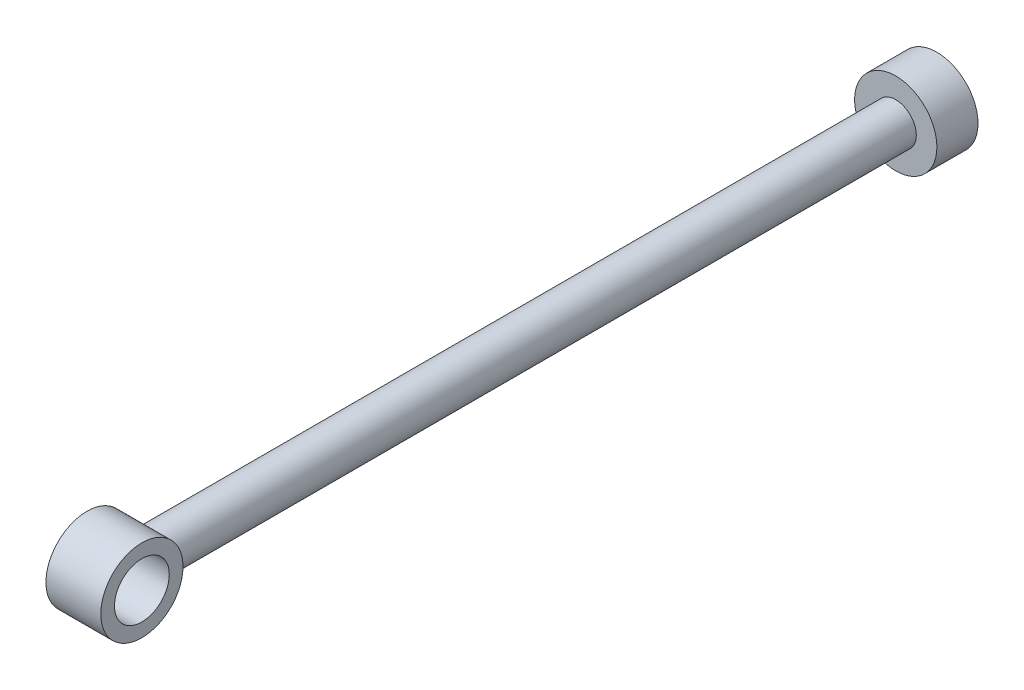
ISO-10303-21;
HEADER;
FILE_DESCRIPTION(('STEP AP214'),'2;1');
FILE_NAME('part.step','',(''),(''),'','','');
FILE_SCHEMA(('AUTOMOTIVE_DESIGN { 1 0 10303 214 1 1 1 1 }'));
ENDSEC;
DATA;
#1=APPLICATION_CONTEXT('core data for automotive mechanical design processes');
#2=APPLICATION_PROTOCOL_DEFINITION('international standard','automotive_design',2000,#1);
#3=PRODUCT_CONTEXT('',#1,'mechanical');
#4=PRODUCT('Part','Part','',(#3));
#5=PRODUCT_RELATED_PRODUCT_CATEGORY('part','',(#4));
#6=PRODUCT_DEFINITION_FORMATION('','',#4);
#7=PRODUCT_DEFINITION_CONTEXT('part definition',#1,'design');
#8=PRODUCT_DEFINITION('design','',#6,#7);
#9=PRODUCT_DEFINITION_SHAPE('','',#8);
#10=(LENGTH_UNIT() NAMED_UNIT(*) SI_UNIT(.MILLI.,.METRE.));
#11=(NAMED_UNIT(*) PLANE_ANGLE_UNIT() SI_UNIT($,.RADIAN.));
#12=(NAMED_UNIT(*) SI_UNIT($,.STERADIAN.) SOLID_ANGLE_UNIT());
#13=UNCERTAINTY_MEASURE_WITH_UNIT(LENGTH_MEASURE(1.E-05),#10,'distance_accuracy_value','');
#14=(GEOMETRIC_REPRESENTATION_CONTEXT(3) GLOBAL_UNCERTAINTY_ASSIGNED_CONTEXT((#13)) GLOBAL_UNIT_ASSIGNED_CONTEXT((#10,
#11,#12)) REPRESENTATION_CONTEXT('',''));
#15=CARTESIAN_POINT('',(0.,0.,0.));
#16=DIRECTION('',(0.,0.,1.));
#17=DIRECTION('',(1.,0.,0.));
#18=AXIS2_PLACEMENT_3D('',#15,#16,#17);
#19=CARTESIAN_POINT('',(0.,0.,575.));
#20=DIRECTION('',(0.,0.,-1.));
#21=DIRECTION('',(-1.,0.,0.));
#22=AXIS2_PLACEMENT_3D('',#19,#20,#21);
#23=CYLINDRICAL_SURFACE('',#22,15.);
#24=CARTESIAN_POINT('',(0.,0.,30.));
#25=DIRECTION('',(0.,0.,1.));
#26=DIRECTION('',(1.,0.,0.));
#27=AXIS2_PLACEMENT_3D('',#24,#25,#26);
#28=CIRCLE('',#27,15.);
#29=CARTESIAN_POINT('',(15.,0.,30.));
#30=VERTEX_POINT('',#29);
#31=EDGE_CURVE('E50',#30,#30,#28,.T.);
#32=ORIENTED_EDGE('',*,*,#31,.T.);
#33=EDGE_LOOP('',(#32));
#34=FACE_BOUND('',#33,.T.);
#35=CARTESIAN_POINT('',(-15.,0.,570.));
#36=CARTESIAN_POINT('',(-14.9999986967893,-0.394466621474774,570.000001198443));
#37=CARTESIAN_POINT('',(-14.9844217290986,-0.788960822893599,570.007798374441));
#38=CARTESIAN_POINT('',(-14.9222912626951,-1.57504384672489,570.038790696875));
#39=CARTESIAN_POINT('',(-14.8757242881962,-1.96663133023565,570.061992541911));
#40=CARTESIAN_POINT('',(-14.752062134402,-2.74444839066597,570.123245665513));
#41=CARTESIAN_POINT('',(-14.674915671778,-3.13066783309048,570.161321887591));
#42=CARTESIAN_POINT('',(-14.4909926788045,-3.89427274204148,570.251345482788));
#43=CARTESIAN_POINT('',(-14.3842191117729,-4.27165908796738,570.303291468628));
#44=CARTESIAN_POINT('',(-14.1426464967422,-5.01370255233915,570.419545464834));
#45=CARTESIAN_POINT('',(-14.0079586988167,-5.37840368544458,570.483804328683));
#46=CARTESIAN_POINT('',(-13.7115835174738,-6.09447648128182,570.623301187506));
#47=CARTESIAN_POINT('',(-13.5498955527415,-6.44584785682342,570.698539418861));
#48=CARTESIAN_POINT('',(-13.2009461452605,-7.13327098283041,570.858261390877));
#49=CARTESIAN_POINT('',(-13.0136941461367,-7.4693283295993,570.942741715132));
#50=CARTESIAN_POINT('',(-12.6148696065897,-8.12479620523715,571.119159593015));
#51=CARTESIAN_POINT('',(-12.4032874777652,-8.44420009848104,571.211100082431));
#52=CARTESIAN_POINT('',(-11.9437431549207,-9.08356730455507,571.406169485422));
#53=CARTESIAN_POINT('',(-11.6943566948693,-9.40240338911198,571.509638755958));
#54=CARTESIAN_POINT('',(-11.1713323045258,-10.0182110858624,571.720301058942));
#55=CARTESIAN_POINT('',(-10.8976929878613,-10.3151814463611,571.827494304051));
#56=CARTESIAN_POINT('',(-10.32744213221,-10.8860835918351,572.043134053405));
#57=CARTESIAN_POINT('',(-10.0308163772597,-11.1600008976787,572.151581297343));
#58=CARTESIAN_POINT('',(-9.41609706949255,-11.6833254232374,572.367048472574));
#59=CARTESIAN_POINT('',(-9.09799950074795,-11.9327280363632,572.474068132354));
#60=CARTESIAN_POINT('',(-8.41621019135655,-12.424066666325,572.692119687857));
#61=CARTESIAN_POINT('',(-8.05089693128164,-12.6639084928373,572.802814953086));
#62=CARTESIAN_POINT('',(-7.29906225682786,-13.1116371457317,573.01581142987));
#63=CARTESIAN_POINT('',(-6.91254992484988,-13.3195375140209,573.118116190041));
#64=CARTESIAN_POINT('',(-6.1204511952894,-13.7015816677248,573.310817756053));
#65=CARTESIAN_POINT('',(-5.71487061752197,-13.8757356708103,573.40121816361));
#66=CARTESIAN_POINT('',(-4.88717106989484,-14.1884178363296,573.566685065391));
#67=CARTESIAN_POINT('',(-4.46505393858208,-14.3269499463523,573.641753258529));
#68=CARTESIAN_POINT('',(-3.6331274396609,-14.5593818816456,573.769465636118));
#69=CARTESIAN_POINT('',(-3.22409061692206,-14.6554546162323,573.823181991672));
#70=CARTESIAN_POINT('',(-2.39742530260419,-14.8131483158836,573.912093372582));
#71=CARTESIAN_POINT('',(-1.97979717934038,-14.874770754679,573.947289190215));
#72=CARTESIAN_POINT('',(-1.1399780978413,-14.9625716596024,573.997615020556));
#73=CARTESIAN_POINT('',(-0.717791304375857,-14.9887801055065,574.012762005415));
#74=CARTESIAN_POINT('',(0.127503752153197,-15.0054120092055,574.022361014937));
#75=CARTESIAN_POINT('',(0.550611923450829,-14.9958388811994,574.016815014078));
#76=CARTESIAN_POINT('',(1.34318604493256,-14.9443693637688,573.987185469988));
#77=CARTESIAN_POINT('',(1.7130074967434,-14.9064815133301,573.965401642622));
#78=CARTESIAN_POINT('',(2.44761394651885,-14.8036048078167,573.90676729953));
#79=CARTESIAN_POINT('',(2.81239941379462,-14.7386184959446,573.869918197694));
#80=CARTESIAN_POINT('',(3.53465011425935,-14.5822778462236,573.782349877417));
#81=CARTESIAN_POINT('',(3.8921134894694,-14.490916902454,573.731627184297));
#82=CARTESIAN_POINT('',(4.5975509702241,-14.2827793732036,573.617879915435));
#83=CARTESIAN_POINT('',(4.94552456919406,-14.1660014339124,573.554854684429));
#84=CARTESIAN_POINT('',(5.63806138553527,-13.9051185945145,573.416735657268));
#85=CARTESIAN_POINT('',(5.98236177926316,-13.7604466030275,573.341397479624));
#86=CARTESIAN_POINT('',(6.6576488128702,-13.4467240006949,573.181786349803));
#87=CARTESIAN_POINT('',(6.9886306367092,-13.2776646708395,573.097510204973));
#88=CARTESIAN_POINT('',(7.63583954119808,-12.9163207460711,572.922168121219));
#89=CARTESIAN_POINT('',(7.95206429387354,-12.724032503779,572.831101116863));
#90=CARTESIAN_POINT('',(8.56852275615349,-12.3173373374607,572.644319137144));
#91=CARTESIAN_POINT('',(8.86875518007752,-12.1029286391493,572.548603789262));
#92=CARTESIAN_POINT('',(9.4892135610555,-11.6244221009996,572.342288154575));
#93=CARTESIAN_POINT('',(9.80713018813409,-11.357472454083,572.23134228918));
#94=CARTESIAN_POINT('',(10.4195910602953,-10.7983337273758,572.009171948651));
#95=CARTESIAN_POINT('',(10.7141433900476,-10.5061534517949,571.897947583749));
#96=CARTESIAN_POINT('',(11.2787205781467,-9.897619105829,571.677890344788));
#97=CARTESIAN_POINT('',(11.5487236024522,-9.58124396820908,571.569059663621));
#98=CARTESIAN_POINT('',(12.0621805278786,-8.9261925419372,571.356648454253));
#99=CARTESIAN_POINT('',(12.3056450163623,-8.58752523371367,571.253065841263));
#100=CARTESIAN_POINT('',(12.7751937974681,-7.87309152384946,571.049027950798));
#101=CARTESIAN_POINT('',(12.999931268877,-7.49633062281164,570.94894596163));
#102=CARTESIAN_POINT('',(13.4165538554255,-6.72229496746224,570.760139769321));
#103=CARTESIAN_POINT('',(13.608437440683,-6.32501925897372,570.671416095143));
#104=CARTESIAN_POINT('',(13.9571914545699,-5.51289034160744,570.507976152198));
#105=CARTESIAN_POINT('',(14.1140841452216,-5.09804850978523,570.433250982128));
#106=CARTESIAN_POINT('',(14.391076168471,-4.25373396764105,570.300028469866));
#107=CARTESIAN_POINT('',(14.5111797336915,-3.82426294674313,570.241529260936));
#108=CARTESIAN_POINT('',(14.7045987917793,-2.99040123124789,570.146713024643));
#109=CARTESIAN_POINT('',(14.780965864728,-2.58687987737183,570.108959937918));
#110=CARTESIAN_POINT('',(14.9004227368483,-1.77375891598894,570.049709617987));
#111=CARTESIAN_POINT('',(14.9435143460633,-1.36415964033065,570.028211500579));
#112=CARTESIAN_POINT('',(14.9958394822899,-0.542432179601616,570.002088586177));
#113=CARTESIAN_POINT('',(15.0050865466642,-0.130305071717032,569.997457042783));
#114=CARTESIAN_POINT('',(14.9896332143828,0.69314293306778,570.005182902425));
#115=CARTESIAN_POINT('',(14.9649343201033,1.10446386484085,570.017539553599));
#116=CARTESIAN_POINT('',(14.8851569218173,1.89104365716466,570.057274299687));
#117=CARTESIAN_POINT('',(14.8325856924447,2.26662317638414,570.083411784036));
#118=CARTESIAN_POINT('',(14.6994449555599,3.01155508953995,570.149198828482));
#119=CARTESIAN_POINT('',(14.6188772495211,3.38090788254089,570.188847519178));
#120=CARTESIAN_POINT('',(14.4305792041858,4.11102643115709,570.280732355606));
#121=CARTESIAN_POINT('',(14.322847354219,4.47179170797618,570.332969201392));
#122=CARTESIAN_POINT('',(14.0812572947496,5.18257720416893,570.448848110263));
#123=CARTESIAN_POINT('',(13.9473979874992,5.53259697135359,570.512490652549));
#124=CARTESIAN_POINT('',(13.6505393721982,6.22979935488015,570.651753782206));
#125=CARTESIAN_POINT('',(13.4868176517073,6.576616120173,570.727664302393));
#126=CARTESIAN_POINT('',(13.1343016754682,7.25508680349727,570.88839960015));
#127=CARTESIAN_POINT('',(12.9455071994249,7.58674058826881,570.973224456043));
#128=CARTESIAN_POINT('',(12.5441531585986,8.23341158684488,571.149985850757));
#129=CARTESIAN_POINT('',(12.3315897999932,8.5484261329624,571.241923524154));
#130=CARTESIAN_POINT('',(11.8839483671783,9.16054648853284,571.431012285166));
#131=CARTESIAN_POINT('',(11.6488615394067,9.45764526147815,571.528165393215));
#132=CARTESIAN_POINT('',(11.1333715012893,10.060839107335,571.735341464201));
#133=CARTESIAN_POINT('',(10.8507851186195,10.3649587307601,571.845692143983));
#134=CARTESIAN_POINT('',(10.2616154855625,10.9485707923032,572.06746929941));
#135=CARTESIAN_POINT('',(9.9550311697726,11.2280621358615,572.178895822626));
#136=CARTESIAN_POINT('',(9.31919419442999,11.761157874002,572.400027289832));
#137=CARTESIAN_POINT('',(8.98992792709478,12.0147464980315,572.50973115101));
#138=CARTESIAN_POINT('',(8.31037887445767,12.4944228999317,572.724397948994));
#139=CARTESIAN_POINT('',(7.96009249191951,12.7205059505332,572.829360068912));
#140=CARTESIAN_POINT('',(7.22261605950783,13.1539172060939,573.036414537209));
#141=CARTESIAN_POINT('',(6.83445930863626,13.3597919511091,573.138116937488));
#142=CARTESIAN_POINT('',(6.03927850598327,13.737567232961,573.329340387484));
#143=CARTESIAN_POINT('',(5.63226376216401,13.9094843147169,573.418867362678));
#144=CARTESIAN_POINT('',(4.80217565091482,14.2174151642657,573.582288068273));
#145=CARTESIAN_POINT('',(4.37911544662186,14.353457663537,573.656194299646));
#146=CARTESIAN_POINT('',(3.51992505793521,14.5879514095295,573.785315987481));
#147=CARTESIAN_POINT('',(3.08379690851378,14.6864084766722,573.840534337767));
#148=CARTESIAN_POINT('',(2.24471283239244,14.8366134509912,573.925460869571));
#149=CARTESIAN_POINT('',(1.84259137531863,14.8919378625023,573.957109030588));
#150=CARTESIAN_POINT('',(1.0341590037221,14.9698153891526,574.0017947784));
#151=CARTESIAN_POINT('',(0.627848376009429,14.9923707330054,574.014833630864));
#152=CARTESIAN_POINT('',(-0.185270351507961,15.0043645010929,574.021757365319));
#153=CARTESIAN_POINT('',(-0.592078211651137,14.9938151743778,574.015649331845));
#154=CARTESIAN_POINT('',(-1.40275816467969,14.9397884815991,573.984549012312));
#155=CARTESIAN_POINT('',(-1.8066303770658,14.8963124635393,573.959557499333));
#156=CARTESIAN_POINT('',(-2.56967168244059,14.782795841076,573.894967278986));
#157=CARTESIAN_POINT('',(-2.92942204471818,14.7156934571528,573.856994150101));
#158=CARTESIAN_POINT('',(-3.64159381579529,14.5558242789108,573.767646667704));
#159=CARTESIAN_POINT('',(-3.99401275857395,14.4630489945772,573.716267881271));
#160=CARTESIAN_POINT('',(-4.68939648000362,14.2527724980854,573.601651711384));
#161=CARTESIAN_POINT('',(-5.0323611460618,14.1352709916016,573.538414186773));
#162=CARTESIAN_POINT('',(-5.70716431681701,13.8765585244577,573.401832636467));
#163=CARTESIAN_POINT('',(-6.0390017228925,13.7353452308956,573.328487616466));
#164=CARTESIAN_POINT('',(-6.71194905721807,13.4200195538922,573.16836954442));
#165=CARTESIAN_POINT('',(-7.05218633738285,13.2443351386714,573.081025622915));
#166=CARTESIAN_POINT('',(-7.71683729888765,12.8684192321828,572.899310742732));
#167=CARTESIAN_POINT('',(-8.04125049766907,12.6681869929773,572.804939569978));
#168=CARTESIAN_POINT('',(-8.67307599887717,12.2442855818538,572.611466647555));
#169=CARTESIAN_POINT('',(-8.98048183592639,12.0206075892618,572.512363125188));
#170=CARTESIAN_POINT('',(-9.57700095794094,11.5509819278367,572.311734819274));
#171=CARTESIAN_POINT('',(-9.86611149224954,11.3050309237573,572.210209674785));
#172=CARTESIAN_POINT('',(-10.4588881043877,10.7607009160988,571.994588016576));
#173=CARTESIAN_POINT('',(-10.7600384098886,10.4595848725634,571.880466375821));
#174=CARTESIAN_POINT('',(-11.3360350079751,9.83237263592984,571.655062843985));
#175=CARTESIAN_POINT('',(-11.6108894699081,9.50628425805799,571.543780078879));
#176=CARTESIAN_POINT('',(-12.1328673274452,8.83040064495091,571.326840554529));
#177=CARTESIAN_POINT('',(-12.3799686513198,8.48058689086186,571.221188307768));
#178=CARTESIAN_POINT('',(-12.8443186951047,7.75934315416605,571.018404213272));
#179=CARTESIAN_POINT('',(-13.0615691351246,7.38791441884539,570.921271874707));
#180=CARTESIAN_POINT('',(-13.4657554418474,6.62283359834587,570.737499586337));
#181=CARTESIAN_POINT('',(-13.652463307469,6.22904153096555,570.650939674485));
#182=CARTESIAN_POINT('',(-13.9917304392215,5.42422205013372,570.491593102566));
#183=CARTESIAN_POINT('',(-14.1442848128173,5.01319217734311,570.418808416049));
#184=CARTESIAN_POINT('',(-14.4130312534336,4.17809175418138,570.289368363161));
#185=CARTESIAN_POINT('',(-14.52931393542,3.75405665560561,570.232672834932));
#186=CARTESIAN_POINT('',(-14.7244141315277,2.89570983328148,570.136960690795));
#187=CARTESIAN_POINT('',(-14.8032545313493,2.46140455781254,570.097933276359));
#188=CARTESIAN_POINT('',(-14.9084233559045,1.68912528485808,570.04570850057));
#189=CARTESIAN_POINT('',(-14.9427351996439,1.35247752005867,570.028597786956));
#190=CARTESIAN_POINT('',(-14.9885243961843,0.677226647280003,570.005742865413));
#191=CARTESIAN_POINT('',(-15.0000011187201,0.338623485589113,569.999998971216));
#192=CARTESIAN_POINT('',(-15.,0.,570.));
#193=B_SPLINE_CURVE_WITH_KNOTS('',3,(#35,#36,#37,#38,#39,#40,#41,#42,#43,#44,#45,#46,#47,#48,
#49,#50,#51,#52,#53,#54,#55,#56,#57,#58,#59,#60,#61,#62,#63,#64,#65,#66,#67,#68,#69,#70,#71,#72,
#73,#74,#75,#76,#77,#78,#79,#80,#81,#82,#83,#84,#85,#86,#87,#88,#89,#90,#91,#92,#93,#94,#95,#96,
#97,#98,#99,#100,#101,#102,#103,#104,#105,#106,#107,#108,#109,#110,#111,#112,#113,#114,#115,
#116,#117,#118,#119,#120,#121,#122,#123,#124,#125,#126,#127,#128,#129,#130,#131,#132,#133,#134,
#135,#136,#137,#138,#139,#140,#141,#142,#143,#144,#145,#146,#147,#148,#149,#150,#151,#152,#153,
#154,#155,#156,#157,#158,#159,#160,#161,#162,#163,#164,#165,#166,#167,#168,#169,#170,#171,#172,
#173,#174,#175,#176,#177,#178,#179,#180,#181,#182,#183,#184,#185,#186,#187,#188,#189,#190,#191,
#192),.UNSPECIFIED.,.T.,.F.,(4,2,2,2,2,2,2,2,2,2,2,2,2,2,2,2,2,2,2,2,2,2,2,2,2,2,2,2,2,2,2,2,2,
2,2,2,2,2,2,2,2,2,2,2,2,2,2,2,2,2,2,2,2,2,2,2,2,2,2,2,2,2,2,2,2,2,2,2,2,2,2,2,2,2,2,2,2,2,4),
(0.,1.1830658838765,2.36664655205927,3.5522205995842,4.73767610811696,5.91849492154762,
7.09933916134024,8.27974835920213,9.46062435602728,10.7126941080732,11.9648354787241,
13.2177575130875,14.4709145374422,15.821667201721,17.1718456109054,18.521614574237,
19.8712338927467,21.1401798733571,22.4090715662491,23.6768884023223,24.9445842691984,
26.0604534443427,27.1762179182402,28.2922620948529,29.4083657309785,30.5501573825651,
31.6923582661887,32.8347387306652,33.9772108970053,35.2649000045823,36.5521415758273,
37.8405170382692,39.1283766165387,40.4765138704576,41.824713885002,43.1720536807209,
44.519238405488,45.7548292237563,46.9903528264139,48.2253821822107,49.4603568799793,
50.5994583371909,51.7384865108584,52.8775780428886,54.0167174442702,55.1883567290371,
56.3600063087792,57.53184316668,58.7041373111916,59.9914055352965,61.2787309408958,
62.5668355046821,63.8551611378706,65.2063513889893,66.5568816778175,67.9063270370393,
69.2555633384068,70.4752824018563,71.6949185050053,72.9141033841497,74.1332383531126,
75.2357784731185,76.3386836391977,77.4416019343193,78.5446288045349,79.7216927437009,
80.8987925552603,82.0763368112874,83.2540576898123,84.5752168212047,85.8959641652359,
87.217754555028,88.539468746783,89.8706389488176,91.2019997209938,92.5300073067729,
93.8572021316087,94.872757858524,95.8883416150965),.UNSPECIFIED.);
#194=CARTESIAN_POINT('',(-15.,0.,570.));
#195=VERTEX_POINT('',#194);
#196=EDGE_CURVE('E10',#195,#195,#193,.T.);
#197=ORIENTED_EDGE('',*,*,#196,.F.);
#198=EDGE_LOOP('',(#197));
#199=FACE_BOUND('',#198,.T.);
#200=ADVANCED_FACE('F30',(#34,#199),#23,.T.);
#201=CARTESIAN_POINT('',(0.,0.,30.));
#202=DIRECTION('',(0.,0.,1.));
#203=DIRECTION('',(1.,0.,0.));
#204=AXIS2_PLACEMENT_3D('',#201,#202,#203);
#205=PLANE('',#204);
#206=CARTESIAN_POINT('',(0.,0.,30.));
#207=DIRECTION('',(0.,0.,1.));
#208=DIRECTION('',(1.,0.,0.));
#209=AXIS2_PLACEMENT_3D('',#206,#207,#208);
#210=CIRCLE('',#209,30.);
#211=CARTESIAN_POINT('',(30.,0.,30.));
#212=VERTEX_POINT('',#211);
#213=EDGE_CURVE('E41',#212,#212,#210,.T.);
#214=ORIENTED_EDGE('',*,*,#213,.T.);
#215=EDGE_LOOP('',(#214));
#216=FACE_BOUND('',#215,.T.);
#217=ORIENTED_EDGE('',*,*,#31,.F.);
#218=EDGE_LOOP('',(#217));
#219=FACE_BOUND('',#218,.T.);
#220=ADVANCED_FACE('F86',(#216,#219),#205,.T.);
#221=CARTESIAN_POINT('',(0.,0.,30.));
#222=DIRECTION('',(0.,0.,-1.));
#223=DIRECTION('',(-1.,0.,0.));
#224=AXIS2_PLACEMENT_3D('',#221,#222,#223);
#225=CYLINDRICAL_SURFACE('',#224,30.);
#226=ORIENTED_EDGE('',*,*,#213,.F.);
#227=EDGE_LOOP('',(#226));
#228=FACE_BOUND('',#227,.T.);
#229=CARTESIAN_POINT('',(0.,0.,0.));
#230=DIRECTION('',(0.,0.,1.));
#231=DIRECTION('',(1.,0.,0.));
#232=AXIS2_PLACEMENT_3D('',#229,#230,#231);
#233=CIRCLE('',#232,30.);
#234=CARTESIAN_POINT('',(30.,0.,0.));
#235=VERTEX_POINT('',#234);
#236=EDGE_CURVE('E45',#235,#235,#233,.T.);
#237=ORIENTED_EDGE('',*,*,#236,.T.);
#238=EDGE_LOOP('',(#237));
#239=FACE_BOUND('',#238,.T.);
#240=ADVANCED_FACE('F32',(#228,#239),#225,.T.);
#241=CARTESIAN_POINT('',(0.,0.,0.));
#242=DIRECTION('',(0.,0.,1.));
#243=DIRECTION('',(1.,0.,0.));
#244=AXIS2_PLACEMENT_3D('',#241,#242,#243);
#245=PLANE('',#244);
#246=ORIENTED_EDGE('',*,*,#236,.F.);
#247=EDGE_LOOP('',(#246));
#248=FACE_BOUND('',#247,.T.);
#249=ADVANCED_FACE('F82',(#248),#245,.F.);
#250=CARTESIAN_POINT('',(20.,0.,600.));
#251=DIRECTION('',(-1.,0.,0.));
#252=DIRECTION('',(0.,0.,1.));
#253=AXIS2_PLACEMENT_3D('',#250,#251,#252);
#254=CYLINDRICAL_SURFACE('',#253,30.);
#255=CARTESIAN_POINT('',(-20.,0.,600.));
#256=DIRECTION('',(1.,0.,0.));
#257=DIRECTION('',(0.,0.,-1.));
#258=AXIS2_PLACEMENT_3D('',#255,#256,#257);
#259=CIRCLE('',#258,30.);
#260=CARTESIAN_POINT('',(-20.,0.,570.));
#261=VERTEX_POINT('',#260);
#262=EDGE_CURVE('E55',#261,#261,#259,.T.);
#263=ORIENTED_EDGE('',*,*,#262,.T.);
#264=EDGE_LOOP('',(#263));
#265=FACE_BOUND('',#264,.T.);
#266=CARTESIAN_POINT('',(20.,0.,600.));
#267=DIRECTION('',(1.,0.,0.));
#268=DIRECTION('',(0.,0.,-1.));
#269=AXIS2_PLACEMENT_3D('',#266,#267,#268);
#270=CIRCLE('',#269,30.);
#271=CARTESIAN_POINT('',(20.,0.,570.));
#272=VERTEX_POINT('',#271);
#273=EDGE_CURVE('E54',#272,#272,#270,.T.);
#274=ORIENTED_EDGE('',*,*,#273,.F.);
#275=EDGE_LOOP('',(#274));
#276=FACE_BOUND('',#275,.T.);
#277=ORIENTED_EDGE('',*,*,#196,.T.);
#278=EDGE_LOOP('',(#277));
#279=FACE_BOUND('',#278,.T.);
#280=ADVANCED_FACE('F73',(#265,#276,#279),#254,.T.);
#281=CARTESIAN_POINT('',(20.,0.,600.));
#282=DIRECTION('',(1.,0.,0.));
#283=DIRECTION('',(0.,0.,-1.));
#284=AXIS2_PLACEMENT_3D('',#281,#282,#283);
#285=PLANE('',#284);
#286=ORIENTED_EDGE('',*,*,#273,.T.);
#287=EDGE_LOOP('',(#286));
#288=FACE_BOUND('',#287,.T.);
#289=CARTESIAN_POINT('',(20.,0.,600.));
#290=DIRECTION('',(1.,0.,0.));
#291=DIRECTION('',(0.,0.,-1.));
#292=AXIS2_PLACEMENT_3D('',#289,#290,#291);
#293=CIRCLE('',#292,20.);
#294=CARTESIAN_POINT('',(20.,0.,580.));
#295=VERTEX_POINT('',#294);
#296=EDGE_CURVE('E58',#295,#295,#293,.T.);
#297=ORIENTED_EDGE('',*,*,#296,.F.);
#298=EDGE_LOOP('',(#297));
#299=FACE_BOUND('',#298,.T.);
#300=ADVANCED_FACE('F70',(#288,#299),#285,.T.);
#301=CARTESIAN_POINT('',(-20.,0.,600.));
#302=DIRECTION('',(1.,0.,0.));
#303=DIRECTION('',(0.,0.,-1.));
#304=AXIS2_PLACEMENT_3D('',#301,#302,#303);
#305=PLANE('',#304);
#306=ORIENTED_EDGE('',*,*,#262,.F.);
#307=EDGE_LOOP('',(#306));
#308=FACE_BOUND('',#307,.T.);
#309=CARTESIAN_POINT('',(-20.,0.,600.));
#310=DIRECTION('',(1.,0.,0.));
#311=DIRECTION('',(0.,0.,-1.));
#312=AXIS2_PLACEMENT_3D('',#309,#310,#311);
#313=CIRCLE('',#312,20.);
#314=CARTESIAN_POINT('',(-20.,0.,580.));
#315=VERTEX_POINT('',#314);
#316=EDGE_CURVE('E61',#315,#315,#313,.T.);
#317=ORIENTED_EDGE('',*,*,#316,.T.);
#318=EDGE_LOOP('',(#317));
#319=FACE_BOUND('',#318,.T.);
#320=ADVANCED_FACE('F72',(#308,#319),#305,.F.);
#321=CARTESIAN_POINT('',(20.,0.,600.));
#322=DIRECTION('',(-1.,0.,0.));
#323=DIRECTION('',(0.,0.,1.));
#324=AXIS2_PLACEMENT_3D('',#321,#322,#323);
#325=CYLINDRICAL_SURFACE('',#324,20.);
#326=ORIENTED_EDGE('',*,*,#296,.T.);
#327=EDGE_LOOP('',(#326));
#328=FACE_BOUND('',#327,.T.);
#329=ORIENTED_EDGE('',*,*,#316,.F.);
#330=EDGE_LOOP('',(#329));
#331=FACE_BOUND('',#330,.T.);
#332=ADVANCED_FACE('F67',(#328,#331),#325,.F.);
#333=CLOSED_SHELL('',(#200,#220,#240,#249,#280,#300,#320,#332));
#334=MANIFOLD_SOLID_BREP('B2',#333);
#335=ADVANCED_BREP_SHAPE_REPRESENTATION('',(#18,#334),#14);
#336=SHAPE_DEFINITION_REPRESENTATION(#9,#335);
ENDSEC;
END-ISO-10303-21;
